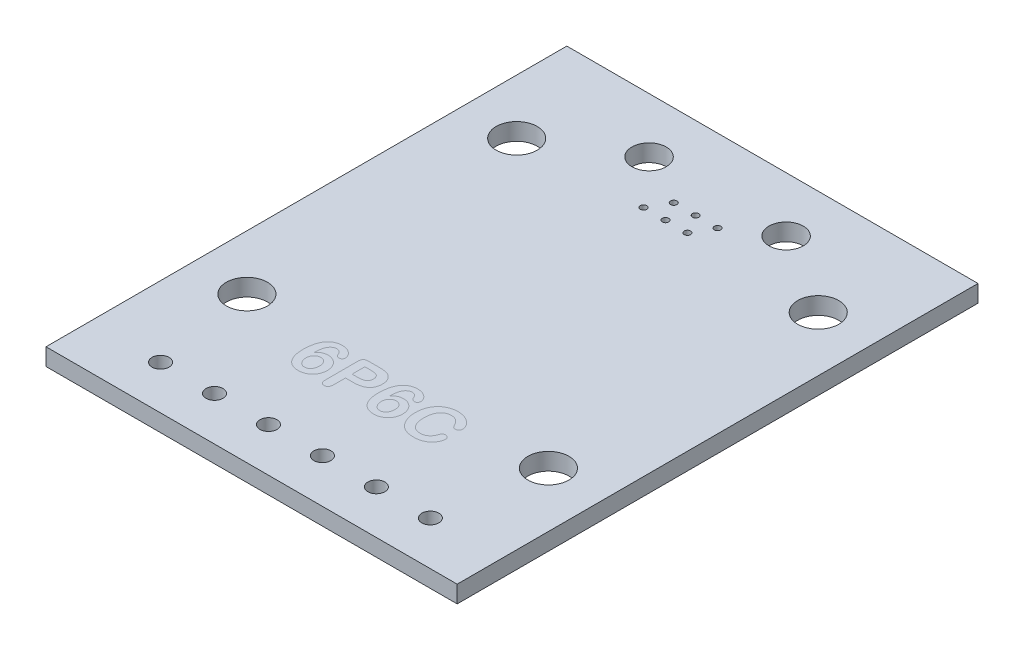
from build123d import *

# Parameters (mm, degrees)
SKETCH1_W           = 38.1
SKETCH1_H           = 48.26
SKETCH1_R           = 1.905
BOSS_EXTRUDE1_DEPTH = 1.5875
SKETCH2_R           = 0.7874
SCREWHOLES_DEPTH    = 62.507379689
SKETCH3_R           = 1.59
CUT_EXTRUDE2_DEPTH  = 62.507379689
SKETCH5_R           = 0.297570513
CUT_EXTRUDE3_DEPTH  = 62.507379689


with BuildPart() as part:
    # Sketch1 → Boss-Extrude1 (new body)
    with BuildSketch(Plane(origin=(0, 0, 0), x_dir=(1, 0, 0), z_dir=(0, 1, 0))):
        with Locations((19.05, 24.13)):
            Rectangle(SKETCH1_W, SKETCH1_H)
        with Locations(Location((5.08, 13.535, 0), (0, 0, 270))):
            Circle(SKETCH1_R, mode=Mode.SUBTRACT)
        with Locations(Location((5.08, 38.535, 0), (0, 0, 270))):
            Circle(SKETCH1_R, mode=Mode.SUBTRACT)
        with Locations(Location((33.02, 13.535, 0), (0, 0, 90))):
            Circle(SKETCH1_R, mode=Mode.SUBTRACT)
        with Locations(Location((33.02, 38.535, 0), (0, 0, 90))):
            Circle(SKETCH1_R, mode=Mode.SUBTRACT)
    extrude(amount=-BOSS_EXTRUDE1_DEPTH)

    # Sketch2 → screwHoles (cut, through all)
    with BuildSketch(Plane(origin=(0, 0, 0), x_dir=(1, 0, 0), z_dir=(0, 1, 0))):
        with Locations(Location((6.55, 4.064, 0), (0, 0, 270))):
            Circle(SKETCH2_R)
        with Locations(Location((11.55, 4.064, 0), (0, 0, 270))):
            Circle(SKETCH2_R)
        with Locations(Location((16.55, 4.064, 0), (0, 0, 270))):
            Circle(SKETCH2_R)
        with Locations(Location((21.55, 4.064, 0), (0, 0, 270))):
            Circle(SKETCH2_R)
        with Locations(Location((26.55, 4.064, 0), (0, 0, 270))):
            Circle(SKETCH2_R)
        with Locations(Location((31.55, 4.064, 0), (0, 0, 270))):
            Circle(SKETCH2_R)
    extrude(amount=-SCREWHOLES_DEPTH, mode=Mode.SUBTRACT)

    # Sketch3 → Cut-Extrude2 (cut, through all)
    with BuildSketch(Plane(origin=(0, 0, 0), x_dir=(1, 0, 0), z_dir=(0, 1, 0))):
        with Locations(Location((12.7, 43.18, 0), (0, 0, 270))):
            Circle(SKETCH3_R)
        with Locations(Location((25.4, 43.18, 0), (0, 0, 90))):
            Circle(SKETCH3_R)
    extrude(amount=-CUT_EXTRUDE2_DEPTH, mode=Mode.SUBTRACT)

    # Sketch5 → Cut-Extrude3 (cut, through all)
    with BuildSketch(Plane.XZ.offset(1.5875)):
        with Locations(Location((16.51, -38.862, 0), (0, 0, 270))):
            Circle(SKETCH5_R)
        with Locations(Location((18.542, -38.862, 0), (0, 0, 270))):
            Circle(SKETCH5_R)
        with Locations(Location((20.574, -38.862, 0), (0, 0, 270))):
            Circle(SKETCH5_R)
        with Locations(Location((17.526, -40.64, 0), (0, 0, 270))):
            Circle(SKETCH5_R)
        with Locations(Location((19.558, -40.64, 0), (0, 0, 270))):
            Circle(SKETCH5_R)
        with Locations(Location((21.59, -40.64, 0), (0, 0, 270))):
            Circle(SKETCH5_R)
    extrude(amount=-CUT_EXTRUDE3_DEPTH, mode=Mode.SUBTRACT)


solid = part.part
